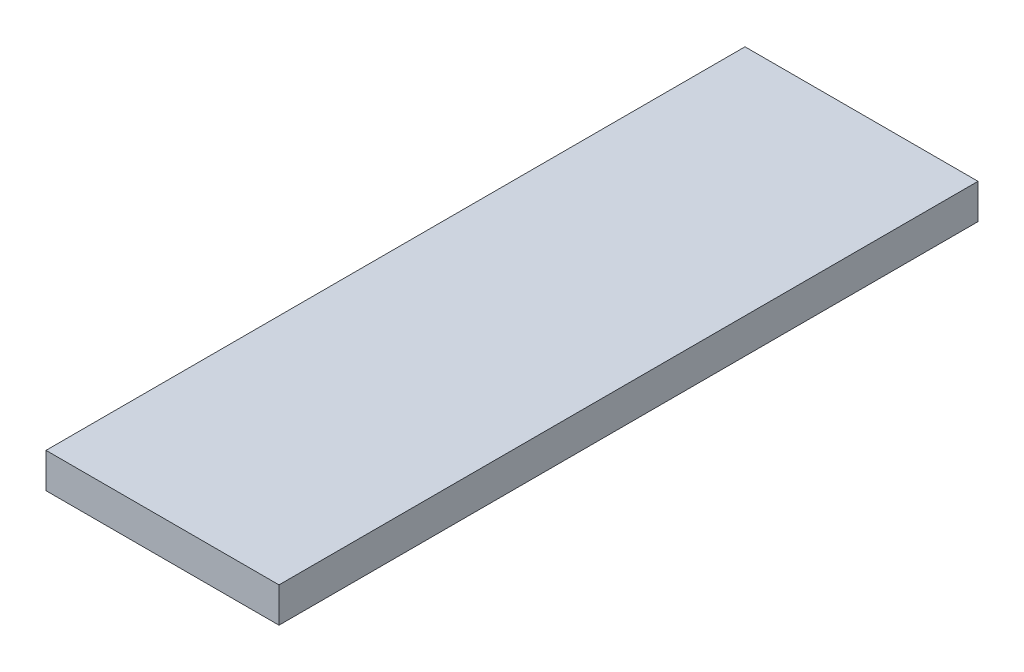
ISO-10303-21;
HEADER;
FILE_DESCRIPTION(('STEP AP214'),'2;1');
FILE_NAME('part.step','',(''),(''),'','','');
FILE_SCHEMA(('AUTOMOTIVE_DESIGN { 1 0 10303 214 1 1 1 1 }'));
ENDSEC;
DATA;
#1=APPLICATION_CONTEXT('core data for automotive mechanical design processes');
#2=APPLICATION_PROTOCOL_DEFINITION('international standard','automotive_design',2000,#1);
#3=PRODUCT_CONTEXT('',#1,'mechanical');
#4=PRODUCT('Part','Part','',(#3));
#5=PRODUCT_RELATED_PRODUCT_CATEGORY('part','',(#4));
#6=PRODUCT_DEFINITION_FORMATION('','',#4);
#7=PRODUCT_DEFINITION_CONTEXT('part definition',#1,'design');
#8=PRODUCT_DEFINITION('design','',#6,#7);
#9=PRODUCT_DEFINITION_SHAPE('','',#8);
#10=(LENGTH_UNIT() NAMED_UNIT(*) SI_UNIT(.MILLI.,.METRE.));
#11=(NAMED_UNIT(*) PLANE_ANGLE_UNIT() SI_UNIT($,.RADIAN.));
#12=(NAMED_UNIT(*) SI_UNIT($,.STERADIAN.) SOLID_ANGLE_UNIT());
#13=UNCERTAINTY_MEASURE_WITH_UNIT(LENGTH_MEASURE(1.E-05),#10,'distance_accuracy_value','');
#14=(GEOMETRIC_REPRESENTATION_CONTEXT(3) GLOBAL_UNCERTAINTY_ASSIGNED_CONTEXT((#13)) GLOBAL_UNIT_ASSIGNED_CONTEXT((#10,
#11,#12)) REPRESENTATION_CONTEXT('',''));
#15=CARTESIAN_POINT('',(0.,0.,0.));
#16=DIRECTION('',(0.,0.,1.));
#17=DIRECTION('',(1.,0.,0.));
#18=AXIS2_PLACEMENT_3D('',#15,#16,#17);
#19=CARTESIAN_POINT('',(0.,6.,0.));
#20=DIRECTION('',(1.,0.,0.));
#21=DIRECTION('',(0.,0.,-1.));
#22=AXIS2_PLACEMENT_3D('',#19,#20,#21);
#23=PLANE('',#22);
#24=DIRECTION('',(0.,0.,1.));
#25=VECTOR('',#24,1.);
#26=CARTESIAN_POINT('',(0.,0.,0.));
#27=LINE('',#26,#25);
#28=CARTESIAN_POINT('',(0.,0.,-120.));
#29=VERTEX_POINT('',#28);
#30=CARTESIAN_POINT('',(0.,0.,0.));
#31=VERTEX_POINT('',#30);
#32=EDGE_CURVE('E96',#29,#31,#27,.T.);
#33=ORIENTED_EDGE('',*,*,#32,.T.);
#34=DIRECTION('',(0.,-1.,0.));
#35=VECTOR('',#34,1.);
#36=CARTESIAN_POINT('',(0.,6.,0.));
#37=LINE('',#36,#35);
#38=CARTESIAN_POINT('',(0.,6.,0.));
#39=VERTEX_POINT('',#38);
#40=EDGE_CURVE('E11',#39,#31,#37,.T.);
#41=ORIENTED_EDGE('',*,*,#40,.F.);
#42=DIRECTION('',(0.,0.,1.));
#43=VECTOR('',#42,1.);
#44=CARTESIAN_POINT('',(0.,6.,0.));
#45=LINE('',#44,#43);
#46=CARTESIAN_POINT('',(0.,6.,-120.));
#47=VERTEX_POINT('',#46);
#48=EDGE_CURVE('E84',#47,#39,#45,.T.);
#49=ORIENTED_EDGE('',*,*,#48,.F.);
#50=DIRECTION('',(0.,-1.,0.));
#51=VECTOR('',#50,1.);
#52=CARTESIAN_POINT('',(0.,6.,-120.));
#53=LINE('',#52,#51);
#54=EDGE_CURVE('E92',#47,#29,#53,.T.);
#55=ORIENTED_EDGE('',*,*,#54,.T.);
#56=EDGE_LOOP('',(#33,#41,#49,#55));
#57=FACE_BOUND('',#56,.T.);
#58=ADVANCED_FACE('F33',(#57),#23,.F.);
#59=CARTESIAN_POINT('',(0.,6.,0.));
#60=DIRECTION('',(0.,0.,-1.));
#61=DIRECTION('',(-1.,0.,0.));
#62=AXIS2_PLACEMENT_3D('',#59,#60,#61);
#63=PLANE('',#62);
#64=DIRECTION('',(1.,0.,0.));
#65=VECTOR('',#64,1.);
#66=CARTESIAN_POINT('',(0.,0.,0.));
#67=LINE('',#66,#65);
#68=CARTESIAN_POINT('',(40.,0.,0.));
#69=VERTEX_POINT('',#68);
#70=EDGE_CURVE('E88',#31,#69,#67,.T.);
#71=ORIENTED_EDGE('',*,*,#70,.T.);
#72=DIRECTION('',(0.,-1.,0.));
#73=VECTOR('',#72,1.);
#74=CARTESIAN_POINT('',(40.,6.,0.));
#75=LINE('',#74,#73);
#76=CARTESIAN_POINT('',(40.,6.,0.));
#77=VERTEX_POINT('',#76);
#78=EDGE_CURVE('E41',#77,#69,#75,.T.);
#79=ORIENTED_EDGE('',*,*,#78,.F.);
#80=DIRECTION('',(1.,0.,0.));
#81=VECTOR('',#80,1.);
#82=CARTESIAN_POINT('',(0.,6.,0.));
#83=LINE('',#82,#81);
#84=EDGE_CURVE('E79',#39,#77,#83,.T.);
#85=ORIENTED_EDGE('',*,*,#84,.F.);
#86=ORIENTED_EDGE('',*,*,#40,.T.);
#87=EDGE_LOOP('',(#71,#79,#85,#86));
#88=FACE_BOUND('',#87,.T.);
#89=ADVANCED_FACE('F87',(#88),#63,.F.);
#90=CARTESIAN_POINT('',(40.,6.,0.));
#91=DIRECTION('',(-1.,0.,0.));
#92=DIRECTION('',(0.,0.,1.));
#93=AXIS2_PLACEMENT_3D('',#90,#91,#92);
#94=PLANE('',#93);
#95=DIRECTION('',(0.,0.,-1.));
#96=VECTOR('',#95,1.);
#97=CARTESIAN_POINT('',(40.,0.,0.));
#98=LINE('',#97,#96);
#99=CARTESIAN_POINT('',(40.,0.,-120.));
#100=VERTEX_POINT('',#99);
#101=EDGE_CURVE('E66',#69,#100,#98,.T.);
#102=ORIENTED_EDGE('',*,*,#101,.T.);
#103=DIRECTION('',(0.,-1.,0.));
#104=VECTOR('',#103,1.);
#105=CARTESIAN_POINT('',(40.,6.,-120.));
#106=LINE('',#105,#104);
#107=CARTESIAN_POINT('',(40.,6.,-120.));
#108=VERTEX_POINT('',#107);
#109=EDGE_CURVE('E89',#108,#100,#106,.T.);
#110=ORIENTED_EDGE('',*,*,#109,.F.);
#111=DIRECTION('',(0.,0.,-1.));
#112=VECTOR('',#111,1.);
#113=CARTESIAN_POINT('',(40.,6.,0.));
#114=LINE('',#113,#112);
#115=EDGE_CURVE('E82',#77,#108,#114,.T.);
#116=ORIENTED_EDGE('',*,*,#115,.F.);
#117=ORIENTED_EDGE('',*,*,#78,.T.);
#118=EDGE_LOOP('',(#102,#110,#116,#117));
#119=FACE_BOUND('',#118,.T.);
#120=ADVANCED_FACE('F90',(#119),#94,.F.);
#121=CARTESIAN_POINT('',(0.,6.,-120.));
#122=DIRECTION('',(0.,0.,1.));
#123=DIRECTION('',(1.,0.,0.));
#124=AXIS2_PLACEMENT_3D('',#121,#122,#123);
#125=PLANE('',#124);
#126=DIRECTION('',(-1.,0.,0.));
#127=VECTOR('',#126,1.);
#128=CARTESIAN_POINT('',(0.,0.,-120.));
#129=LINE('',#128,#127);
#130=EDGE_CURVE('E72',#100,#29,#129,.T.);
#131=ORIENTED_EDGE('',*,*,#130,.T.);
#132=ORIENTED_EDGE('',*,*,#54,.F.);
#133=DIRECTION('',(-1.,0.,0.));
#134=VECTOR('',#133,1.);
#135=CARTESIAN_POINT('',(0.,6.,-120.));
#136=LINE('',#135,#134);
#137=EDGE_CURVE('E49',#108,#47,#136,.T.);
#138=ORIENTED_EDGE('',*,*,#137,.F.);
#139=ORIENTED_EDGE('',*,*,#109,.T.);
#140=EDGE_LOOP('',(#131,#132,#138,#139));
#141=FACE_BOUND('',#140,.T.);
#142=ADVANCED_FACE('F103',(#141),#125,.F.);
#143=CARTESIAN_POINT('',(0.,6.,0.));
#144=DIRECTION('',(0.,-1.,0.));
#145=DIRECTION('',(0.,0.,-1.));
#146=AXIS2_PLACEMENT_3D('',#143,#144,#145);
#147=PLANE('',#146);
#148=ORIENTED_EDGE('',*,*,#48,.T.);
#149=ORIENTED_EDGE('',*,*,#84,.T.);
#150=ORIENTED_EDGE('',*,*,#115,.T.);
#151=ORIENTED_EDGE('',*,*,#137,.T.);
#152=EDGE_LOOP('',(#148,#149,#150,#151));
#153=FACE_BOUND('',#152,.T.);
#154=ADVANCED_FACE('F80',(#153),#147,.F.);
#155=CARTESIAN_POINT('',(0.,0.,0.));
#156=DIRECTION('',(0.,-1.,0.));
#157=DIRECTION('',(0.,0.,-1.));
#158=AXIS2_PLACEMENT_3D('',#155,#156,#157);
#159=PLANE('',#158);
#160=ORIENTED_EDGE('',*,*,#32,.F.);
#161=ORIENTED_EDGE('',*,*,#130,.F.);
#162=ORIENTED_EDGE('',*,*,#101,.F.);
#163=ORIENTED_EDGE('',*,*,#70,.F.);
#164=EDGE_LOOP('',(#160,#161,#162,#163));
#165=FACE_BOUND('',#164,.T.);
#166=ADVANCED_FACE('F106',(#165),#159,.T.);
#167=CLOSED_SHELL('',(#58,#89,#120,#142,#154,#166));
#168=MANIFOLD_SOLID_BREP('B2',#167);
#169=ADVANCED_BREP_SHAPE_REPRESENTATION('',(#18,#168),#14);
#170=SHAPE_DEFINITION_REPRESENTATION(#9,#169);
ENDSEC;
END-ISO-10303-21;
